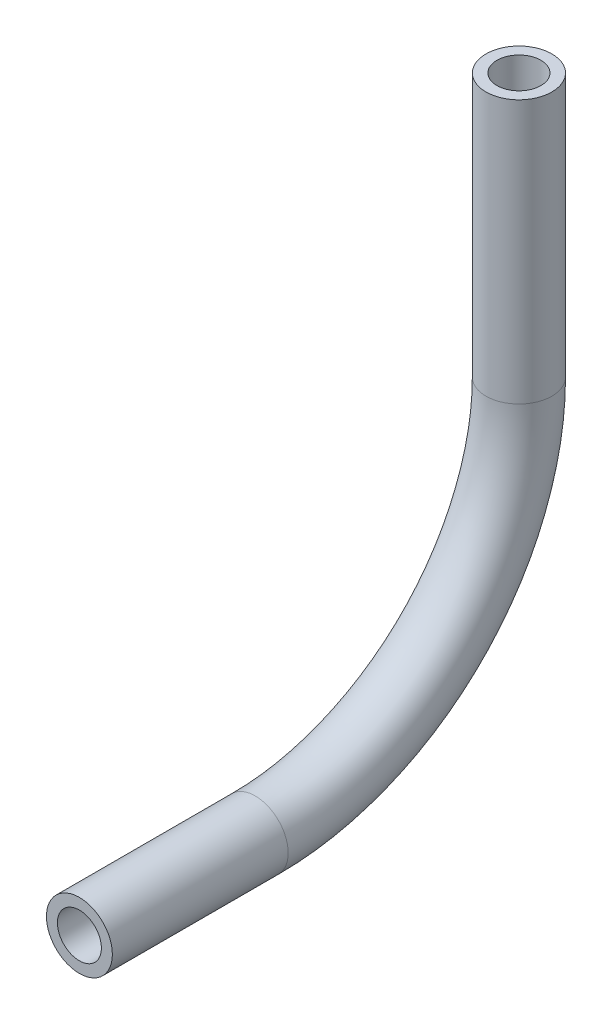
from build123d import *

# Parameters (mm, degrees)
SKETCH1_R   = 9.525
SKETCH1_R_2 = 6.35


with BuildPart() as part:
    # Sweep1: sweep along a path in Sketch2
    with BuildLine(Plane(origin=(0, 0, 0), x_dir=(0, 0, -1), z_dir=(1, 0, 0))) as sweep1_path:
        Line((0, 0), (50.8, 0))
        ThreePointArc((50.8, 0), (104.681536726, 22.318463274), (127, 76.2))
        Line((127, 76.2), (127, 152.329331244))
    # Sketch1 → Sweep1 (sweep)
    with BuildSketch(Plane.XY):
        Circle(SKETCH1_R)
        Circle(SKETCH1_R_2, mode=Mode.SUBTRACT)
    sweep(path=sweep1_path.line)


solid = part.part
